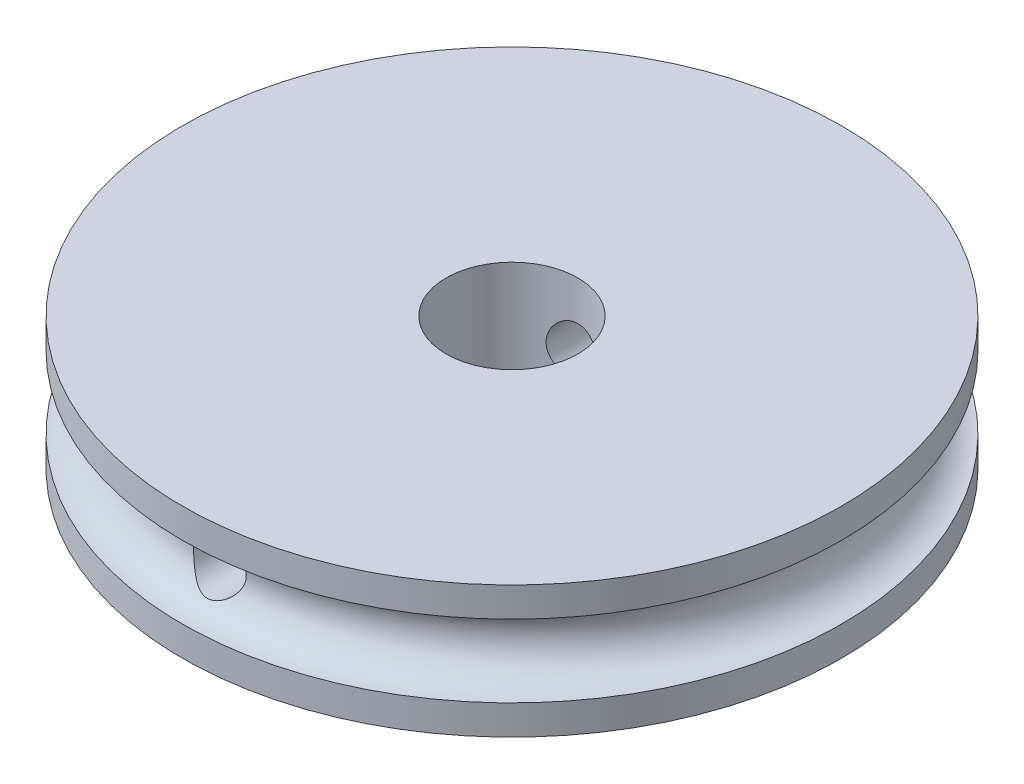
ISO-10303-21;
HEADER;
FILE_DESCRIPTION(('STEP AP214'),'2;1');
FILE_NAME('part.step','',(''),(''),'','','');
FILE_SCHEMA(('AUTOMOTIVE_DESIGN { 1 0 10303 214 1 1 1 1 }'));
ENDSEC;
DATA;
#1=APPLICATION_CONTEXT('core data for automotive mechanical design processes');
#2=APPLICATION_PROTOCOL_DEFINITION('international standard','automotive_design',2000,#1);
#3=PRODUCT_CONTEXT('',#1,'mechanical');
#4=PRODUCT('Part','Part','',(#3));
#5=PRODUCT_RELATED_PRODUCT_CATEGORY('part','',(#4));
#6=PRODUCT_DEFINITION_FORMATION('','',#4);
#7=PRODUCT_DEFINITION_CONTEXT('part definition',#1,'design');
#8=PRODUCT_DEFINITION('design','',#6,#7);
#9=PRODUCT_DEFINITION_SHAPE('','',#8);
#10=(LENGTH_UNIT() NAMED_UNIT(*) SI_UNIT(.MILLI.,.METRE.));
#11=(NAMED_UNIT(*) PLANE_ANGLE_UNIT() SI_UNIT($,.RADIAN.));
#12=(NAMED_UNIT(*) SI_UNIT($,.STERADIAN.) SOLID_ANGLE_UNIT());
#13=UNCERTAINTY_MEASURE_WITH_UNIT(LENGTH_MEASURE(1.E-05),#10,'distance_accuracy_value','');
#14=(GEOMETRIC_REPRESENTATION_CONTEXT(3) GLOBAL_UNCERTAINTY_ASSIGNED_CONTEXT((#13)) GLOBAL_UNIT_ASSIGNED_CONTEXT((#10,
#11,#12)) REPRESENTATION_CONTEXT('',''));
#15=CARTESIAN_POINT('',(0.,0.,0.));
#16=DIRECTION('',(0.,0.,1.));
#17=DIRECTION('',(1.,0.,0.));
#18=AXIS2_PLACEMENT_3D('',#15,#16,#17);
#19=CARTESIAN_POINT('',(0.,10.,0.));
#20=DIRECTION('',(0.,-1.,0.));
#21=DIRECTION('',(0.,0.,-1.));
#22=AXIS2_PLACEMENT_3D('',#19,#20,#21);
#23=CYLINDRICAL_SURFACE('',#22,25.);
#24=CARTESIAN_POINT('',(0.,7.75,0.));
#25=DIRECTION('',(0.,1.,0.));
#26=DIRECTION('',(0.,0.,1.));
#27=AXIS2_PLACEMENT_3D('',#24,#25,#26);
#28=CIRCLE('',#27,25.);
#29=CARTESIAN_POINT('',(0.,7.75,25.));
#30=VERTEX_POINT('',#29);
#31=EDGE_CURVE('E30',#30,#30,#28,.T.);
#32=ORIENTED_EDGE('',*,*,#31,.T.);
#33=EDGE_LOOP('',(#32));
#34=FACE_BOUND('',#33,.T.);
#35=CARTESIAN_POINT('',(0.,10.,0.));
#36=DIRECTION('',(0.,-1.,0.));
#37=DIRECTION('',(0.,0.,-1.));
#38=AXIS2_PLACEMENT_3D('',#35,#36,#37);
#39=CIRCLE('',#38,25.);
#40=CARTESIAN_POINT('',(0.,10.,-25.));
#41=VERTEX_POINT('',#40);
#42=EDGE_CURVE('E18',#41,#41,#39,.F.);
#43=ORIENTED_EDGE('',*,*,#42,.F.);
#44=EDGE_LOOP('',(#43));
#45=FACE_BOUND('',#44,.T.);
#46=ADVANCED_FACE('F15',(#34,#45),#23,.T.);
#47=CARTESIAN_POINT('',(0.,5.,-25.));
#48=DIRECTION('',(0.,0.,1.));
#49=DIRECTION('',(1.,0.,0.));
#50=AXIS2_PLACEMENT_3D('',#47,#48,#49);
#51=CYLINDRICAL_SURFACE('',#50,2.);
#52=CARTESIAN_POINT('',(1.99999999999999,5.,-22.1599300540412));
#53=CARTESIAN_POINT('',(1.99999952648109,4.9519681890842,-22.1599305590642));
#54=CARTESIAN_POINT('',(1.99826504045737,4.90392474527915,-22.1613548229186));
#55=CARTESIAN_POINT('',(1.99136551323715,4.80824187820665,-22.167007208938));
#56=CARTESIAN_POINT('',(1.98619843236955,4.76060271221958,-22.171236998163));
#57=CARTESIAN_POINT('',(1.96563924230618,4.61872068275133,-22.1880127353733));
#58=CARTESIAN_POINT('',(1.94518945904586,4.52562366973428,-22.2046447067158));
#59=CARTESIAN_POINT('',(1.89234905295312,4.34597120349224,-22.2470130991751));
#60=CARTESIAN_POINT('',(1.86004336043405,4.25937437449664,-22.2726847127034));
#61=CARTESIAN_POINT('',(1.78505882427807,4.09343709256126,-22.3310719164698));
#62=CARTESIAN_POINT('',(1.74237983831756,4.01409673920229,-22.3637876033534));
#63=CARTESIAN_POINT('',(1.63107045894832,3.83628393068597,-22.446806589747));
#64=CARTESIAN_POINT('',(1.55862588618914,3.74118351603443,-22.4992050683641));
#65=CARTESIAN_POINT('',(1.39935979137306,3.56617447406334,-22.6081135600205));
#66=CARTESIAN_POINT('',(1.31249617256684,3.48631184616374,-22.664635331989));
#67=CARTESIAN_POINT('',(1.17173970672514,3.37809206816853,-22.748654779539));
#68=CARTESIAN_POINT('',(1.12268956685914,3.34374558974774,-22.7767312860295));
#69=CARTESIAN_POINT('',(1.02118717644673,3.27930423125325,-22.8316869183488));
#70=CARTESIAN_POINT('',(0.968733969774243,3.24921055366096,-22.8585657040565));
#71=CARTESIAN_POINT('',(0.860625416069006,3.19362143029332,-22.9100645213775));
#72=CARTESIAN_POINT('',(0.804980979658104,3.16811142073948,-22.9346915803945));
#73=CARTESIAN_POINT('',(0.690423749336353,3.12193376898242,-22.9806386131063));
#74=CARTESIAN_POINT('',(0.631511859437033,3.10126479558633,-23.0019594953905));
#75=CARTESIAN_POINT('',(0.496648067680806,3.06109839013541,-23.0443537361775));
#76=CARTESIAN_POINT('',(0.419887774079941,3.04295781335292,-23.0642479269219));
#77=CARTESIAN_POINT('',(0.302358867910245,3.02258708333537,-23.0869205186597));
#78=CARTESIAN_POINT('',(0.262833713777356,3.01693957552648,-23.0932798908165));
#79=CARTESIAN_POINT('',(0.183193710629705,3.00800576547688,-23.1033907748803));
#80=CARTESIAN_POINT('',(0.14307925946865,3.00471793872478,-23.1071439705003));
#81=CARTESIAN_POINT('',(0.0857297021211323,3.00176464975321,-23.1105203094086));
#82=CARTESIAN_POINT('',(0.0686016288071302,3.00110336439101,-23.1112773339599));
#83=CARTESIAN_POINT('',(0.0343167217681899,3.00022087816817,-23.112288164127));
#84=CARTESIAN_POINT('',(0.0171598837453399,2.99999975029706,-23.1125418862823));
#85=CARTESIAN_POINT('',(-0.0461655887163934,3.00000067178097,-23.1125400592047));
#86=CARTESIAN_POINT('',(-0.0923532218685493,3.00160363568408,-23.110698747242));
#87=CARTESIAN_POINT('',(-0.184250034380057,3.00797149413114,-23.1034359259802));
#88=CARTESIAN_POINT('',(-0.229958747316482,3.0127392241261,-23.0980112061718));
#89=CARTESIAN_POINT('',(-0.320577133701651,3.02532813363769,-23.0838562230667));
#90=CARTESIAN_POINT('',(-0.365483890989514,3.0331587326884,-23.0751157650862));
#91=CARTESIAN_POINT('',(-0.454043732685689,3.05169446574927,-23.0547530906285));
#92=CARTESIAN_POINT('',(-0.49769601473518,3.06240139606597,-23.0431290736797));
#93=CARTESIAN_POINT('',(-0.625113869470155,3.09817697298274,-23.0050427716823));
#94=CARTESIAN_POINT('',(-0.706782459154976,3.1271117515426,-22.9751130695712));
#95=CARTESIAN_POINT('',(-0.86367987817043,3.19407756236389,-22.909455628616));
#96=CARTESIAN_POINT('',(-0.938906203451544,3.23211211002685,-22.8737256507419));
#97=CARTESIAN_POINT('',(-1.06445716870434,3.30566358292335,-22.80882596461));
#98=CARTESIAN_POINT('',(-1.11622537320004,3.33933085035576,-22.7803194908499));
#99=CARTESIAN_POINT('',(-1.21618563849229,3.41107550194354,-22.7225843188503));
#100=CARTESIAN_POINT('',(-1.26437626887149,3.44915463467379,-22.6933553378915));
#101=CARTESIAN_POINT('',(-1.40350957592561,3.56987932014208,-22.605824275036));
#102=CARTESIAN_POINT('',(-1.48906918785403,3.65904485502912,-22.5476476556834));
#103=CARTESIAN_POINT('',(-1.62969118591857,3.83618965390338,-22.4478155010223));
#104=CARTESIAN_POINT('',(-1.68746979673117,3.92142226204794,-22.405081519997));
#105=CARTESIAN_POINT('',(-1.79028968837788,4.10242260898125,-22.32721145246));
#106=CARTESIAN_POINT('',(-1.83535020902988,4.19817412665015,-22.2920639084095));
#107=CARTESIAN_POINT('',(-1.90391062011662,4.38116792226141,-22.2378320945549));
#108=CARTESIAN_POINT('',(-1.92979506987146,4.46700332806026,-22.2170187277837));
#109=CARTESIAN_POINT('',(-1.96992056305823,4.64293026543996,-22.184555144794));
#110=CARTESIAN_POINT('',(-1.98419136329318,4.73301029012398,-22.1728815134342));
#111=CARTESIAN_POINT('',(-1.99481687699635,4.85311722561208,-22.1641799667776));
#112=CARTESIAN_POINT('',(-1.99675814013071,4.88243028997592,-22.1625888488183));
#113=CARTESIAN_POINT('',(-1.99934995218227,4.94116077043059,-22.1604636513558));
#114=CARTESIAN_POINT('',(-2.00000029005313,4.97057820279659,-22.1599297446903));
#115=CARTESIAN_POINT('',(-1.9999995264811,5.04803181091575,-22.1599305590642));
#116=CARTESIAN_POINT('',(-1.99826504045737,5.09607525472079,-22.1613548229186));
#117=CARTESIAN_POINT('',(-1.99136551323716,5.19175812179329,-22.167007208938));
#118=CARTESIAN_POINT('',(-1.98619843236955,5.23939728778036,-22.171236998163));
#119=CARTESIAN_POINT('',(-1.9656392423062,5.38127931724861,-22.1880127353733));
#120=CARTESIAN_POINT('',(-1.94518945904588,5.47437633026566,-22.2046447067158));
#121=CARTESIAN_POINT('',(-1.89234905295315,5.6540287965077,-22.2470130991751));
#122=CARTESIAN_POINT('',(-1.86004336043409,5.74062562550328,-22.2726847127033));
#123=CARTESIAN_POINT('',(-1.78505882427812,5.90656290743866,-22.3310719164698));
#124=CARTESIAN_POINT('',(-1.7423798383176,5.98590326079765,-22.3637876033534));
#125=CARTESIAN_POINT('',(-1.63107045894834,6.16371606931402,-22.446806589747));
#126=CARTESIAN_POINT('',(-1.55862588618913,6.2588164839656,-22.4992050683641));
#127=CARTESIAN_POINT('',(-1.39935979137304,6.43382552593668,-22.6081135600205));
#128=CARTESIAN_POINT('',(-1.31249617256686,6.51368815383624,-22.664635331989));
#129=CARTESIAN_POINT('',(-1.17173970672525,6.62190793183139,-22.748654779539));
#130=CARTESIAN_POINT('',(-1.12268956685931,6.65625441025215,-22.7767312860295));
#131=CARTESIAN_POINT('',(-1.02118717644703,6.72069576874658,-22.8316869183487));
#132=CARTESIAN_POINT('',(-0.968733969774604,6.75078944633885,-22.8585657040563));
#133=CARTESIAN_POINT('',(-0.860625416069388,6.80637856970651,-22.9100645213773));
#134=CARTESIAN_POINT('',(-0.804980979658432,6.83188857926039,-22.9346915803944));
#135=CARTESIAN_POINT('',(-0.690423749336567,6.87806623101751,-22.9806386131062));
#136=CARTESIAN_POINT('',(-0.63151185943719,6.89873520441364,-23.0019594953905));
#137=CARTESIAN_POINT('',(-0.496648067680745,6.9389016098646,-23.0443537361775));
#138=CARTESIAN_POINT('',(-0.41988777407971,6.95704218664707,-23.0642479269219));
#139=CARTESIAN_POINT('',(-0.302358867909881,6.97741291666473,-23.0869205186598));
#140=CARTESIAN_POINT('',(-0.262833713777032,6.98306042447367,-23.0932798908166));
#141=CARTESIAN_POINT('',(-0.183193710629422,6.99199423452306,-23.1033907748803));
#142=CARTESIAN_POINT('',(-0.143079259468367,6.99528206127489,-23.1071439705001));
#143=CARTESIAN_POINT('',(-0.0857297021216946,6.99823535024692,-23.1105203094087));
#144=CARTESIAN_POINT('',(-0.0686016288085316,6.99889663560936,-23.11127733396));
#145=CARTESIAN_POINT('',(-0.034316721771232,6.99977912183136,-23.1122881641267));
#146=CARTESIAN_POINT('',(-0.0171598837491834,7.00000024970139,-23.1125418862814));
#147=CARTESIAN_POINT('',(0.0461655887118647,6.99999932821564,-23.1125400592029));
#148=CARTESIAN_POINT('',(0.0923532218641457,6.99839636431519,-23.1106987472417));
#149=CARTESIAN_POINT('',(0.184250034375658,6.99202850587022,-23.1034359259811));
#150=CARTESIAN_POINT('',(0.229958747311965,6.98726077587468,-23.0980112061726));
#151=CARTESIAN_POINT('',(0.320577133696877,6.97467186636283,-23.0838562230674));
#152=CARTESIAN_POINT('',(0.365483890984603,6.96684126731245,-23.0751157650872));
#153=CARTESIAN_POINT('',(0.454043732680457,6.94830553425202,-23.0547530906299));
#154=CARTESIAN_POINT('',(0.497696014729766,6.93759860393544,-23.0431290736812));
#155=CARTESIAN_POINT('',(0.625113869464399,6.9018230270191,-23.0050427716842));
#156=CARTESIAN_POINT('',(0.706782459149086,6.8728882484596,-22.9751130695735));
#157=CARTESIAN_POINT('',(0.863679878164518,6.80592243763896,-22.9094556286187));
#158=CARTESIAN_POINT('',(0.938906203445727,6.76788788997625,-22.8737256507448));
#159=CARTESIAN_POINT('',(1.06445716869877,6.69433641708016,-22.808825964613));
#160=CARTESIAN_POINT('',(1.1162253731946,6.6606691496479,-22.7803194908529));
#161=CARTESIAN_POINT('',(1.21618563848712,6.58892449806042,-22.7225843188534));
#162=CARTESIAN_POINT('',(1.26437626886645,6.55084536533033,-22.6933553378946));
#163=CARTESIAN_POINT('',(1.40350957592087,6.43012067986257,-22.6058242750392));
#164=CARTESIAN_POINT('',(1.48906918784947,6.34095514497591,-22.5476476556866));
#165=CARTESIAN_POINT('',(1.62969118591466,6.1638103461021,-22.4478155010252));
#166=CARTESIAN_POINT('',(1.68746979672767,6.07857773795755,-22.4050815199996));
#167=CARTESIAN_POINT('',(1.79028968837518,5.89757739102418,-22.3272114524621));
#168=CARTESIAN_POINT('',(1.83535020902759,5.80182587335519,-22.2920639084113));
#169=CARTESIAN_POINT('',(1.90391062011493,5.61883207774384,-22.2378320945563));
#170=CARTESIAN_POINT('',(1.92979506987,5.53299667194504,-22.2170187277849));
#171=CARTESIAN_POINT('',(1.96992056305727,5.35706973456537,-22.1845551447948));
#172=CARTESIAN_POINT('',(1.98419136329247,5.26698970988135,-22.1728815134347));
#173=CARTESIAN_POINT('',(1.99481687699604,5.14688277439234,-22.1641799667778));
#174=CARTESIAN_POINT('',(1.99675814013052,5.11756971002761,-22.1625888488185));
#175=CARTESIAN_POINT('',(1.99934995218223,5.05883922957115,-22.1604636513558));
#176=CARTESIAN_POINT('',(2.00000029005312,5.02942179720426,-22.1599297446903));
#177=CARTESIAN_POINT('',(1.99999999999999,5.,-22.1599300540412));
#178=B_SPLINE_CURVE_WITH_KNOTS('',3,(#52,#53,#54,#55,#56,#57,#58,#59,#60,#61,#62,#63,#64,#65,
#66,#67,#68,#69,#70,#71,#72,#73,#74,#75,#76,#77,#78,#79,#80,#81,#82,#83,#84,#85,#86,#87,#88,#89,
#90,#91,#92,#93,#94,#95,#96,#97,#98,#99,#100,#101,#102,#103,#104,#105,#106,#107,#108,#109,#110,
#111,#112,#113,#114,#115,#116,#117,#118,#119,#120,#121,#122,#123,#124,#125,#126,#127,#128,#129,
#130,#131,#132,#133,#134,#135,#136,#137,#138,#139,#140,#141,#142,#143,#144,#145,#146,#147,#148,
#149,#150,#151,#152,#153,#154,#155,#156,#157,#158,#159,#160,#161,#162,#163,#164,#165,#166,#167,
#168,#169,#170,#171,#172,#173,#174,#175,#176,#177),.UNSPECIFIED.,.T.,.F.,(4,2,2,2,2,2,2,2,2,2,2,
2,2,2,2,2,2,2,2,2,2,2,2,2,2,2,2,2,2,2,2,2,2,2,2,2,2,2,2,2,2,2,2,2,2,2,2,2,2,2,2,2,2,2,2,2,2,2,2,
2,2,2,4),(0.,0.144058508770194,0.288202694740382,0.576817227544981,0.863403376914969,
1.14999345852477,1.53958291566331,1.93033046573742,2.12854944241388,2.32682435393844,
2.52445769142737,2.72203661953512,2.96494779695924,3.08611074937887,3.20719535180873,
3.25865726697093,3.31012771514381,3.44859972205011,3.58719595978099,3.72622183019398,
3.86533472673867,4.139182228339,4.4131356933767,4.61693224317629,4.82080984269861,
5.22835378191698,5.56160702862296,5.89435339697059,6.16935630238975,6.44365234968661,
6.53188070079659,6.62012347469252,6.76418198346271,6.9083261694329,7.19694070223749,
7.48352685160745,7.77011693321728,8.15970639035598,8.55045394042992,8.74867291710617,
8.9469478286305,9.14458116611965,9.34216009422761,9.58507127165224,9.70623422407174,
9.82731882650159,9.87878074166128,9.93025118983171,10.0687231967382,10.2073194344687,
10.3463453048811,10.4854582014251,10.7593057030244,11.0332591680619,11.2370557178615,
11.4409333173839,11.8484772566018,12.1817305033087,12.5144768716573,12.7894797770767,
13.0637758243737,13.1520041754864,13.240246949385),.UNSPECIFIED.);
#179=CARTESIAN_POINT('',(1.99999999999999,5.,-22.1599300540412));
#180=VERTEX_POINT('',#179);
#181=EDGE_CURVE('E61',#180,#180,#178,.T.);
#182=ORIENTED_EDGE('',*,*,#181,.T.);
#183=EDGE_LOOP('',(#182));
#184=FACE_BOUND('',#183,.T.);
#185=CARTESIAN_POINT('',(0.,3.,-5.));
#186=CARTESIAN_POINT('',(0.107680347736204,3.00000415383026,-4.99999665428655));
#187=CARTESIAN_POINT('',(0.215405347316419,3.00873343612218,-4.99648702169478));
#188=CARTESIAN_POINT('',(0.42767892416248,3.0432996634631,-4.98281368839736));
#189=CARTESIAN_POINT('',(0.53222499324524,3.06914976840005,-4.97264486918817));
#190=CARTESIAN_POINT('',(0.734936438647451,3.13686789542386,-4.94674533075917));
#191=CARTESIAN_POINT('',(0.833117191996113,3.17869549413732,-4.93102865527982));
#192=CARTESIAN_POINT('',(1.02102929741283,3.27699345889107,-4.89557507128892));
#193=CARTESIAN_POINT('',(1.1107597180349,3.33346543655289,-4.87583772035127));
#194=CARTESIAN_POINT('',(1.28349946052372,3.46223381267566,-4.8333093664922));
#195=CARTESIAN_POINT('',(1.36605856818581,3.53510265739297,-4.81042399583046));
#196=CARTESIAN_POINT('',(1.51817177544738,3.69339678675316,-4.76460683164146));
#197=CARTESIAN_POINT('',(1.58771891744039,3.77882874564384,-4.74167501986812));
#198=CARTESIAN_POINT('',(1.71490201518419,3.96446585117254,-4.69721815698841));
#199=CARTESIAN_POINT('',(1.77186247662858,4.06516226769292,-4.67580259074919));
#200=CARTESIAN_POINT('',(1.86778931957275,4.2756406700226,-4.63832295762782));
#201=CARTESIAN_POINT('',(1.90677948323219,4.38541041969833,-4.62225182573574));
#202=CARTESIAN_POINT('',(1.95714803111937,4.57965717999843,-4.60109623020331));
#203=CARTESIAN_POINT('',(1.97317642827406,4.66275735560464,-4.59420393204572));
#204=CARTESIAN_POINT('',(1.99460320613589,4.83056249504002,-4.58494225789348));
#205=CARTESIAN_POINT('',(2.00000349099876,4.91526716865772,-4.58257207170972));
#206=CARTESIAN_POINT('',(1.99999557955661,5.10729212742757,-4.58258028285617));
#207=CARTESIAN_POINT('',(1.99132693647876,5.21462940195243,-4.58639095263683));
#208=CARTESIAN_POINT('',(1.95702361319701,5.42609516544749,-4.60112927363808));
#209=CARTESIAN_POINT('',(1.9313742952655,5.53022080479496,-4.61206306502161));
#210=CARTESIAN_POINT('',(1.86424202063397,5.73203783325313,-4.63960148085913));
#211=CARTESIAN_POINT('',(1.82280828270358,5.82974812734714,-4.65618846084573));
#212=CARTESIAN_POINT('',(1.72544157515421,6.01684954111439,-4.69313894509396));
#213=CARTESIAN_POINT('',(1.66950621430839,6.10623928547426,-4.71350307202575));
#214=CARTESIAN_POINT('',(1.54132425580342,6.27925792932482,-4.75700791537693));
#215=CARTESIAN_POINT('',(1.46838464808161,6.36235116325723,-4.78023770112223));
#216=CARTESIAN_POINT('',(1.30971391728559,6.51552450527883,-4.82612312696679));
#217=CARTESIAN_POINT('',(1.22397753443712,6.58559923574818,-4.84877852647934));
#218=CARTESIAN_POINT('',(1.03796954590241,6.71343313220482,-4.89204323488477));
#219=CARTESIAN_POINT('',(0.937255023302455,6.77059061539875,-4.91253510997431));
#220=CARTESIAN_POINT('',(0.72672428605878,6.86687731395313,-4.9480517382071));
#221=CARTESIAN_POINT('',(0.616919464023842,6.90602870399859,-4.96308321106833));
#222=CARTESIAN_POINT('',(0.422274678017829,6.95675138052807,-4.9828207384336));
#223=CARTESIAN_POINT('',(0.33878005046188,6.97293003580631,-4.98922395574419));
#224=CARTESIAN_POINT('',(0.170199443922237,6.99455529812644,-4.99781463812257));
#225=CARTESIAN_POINT('',(0.0851136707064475,7.00000328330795,-5.00000264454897));
#226=CARTESIAN_POINT('',(-0.107680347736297,6.99999584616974,-4.99999665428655));
#227=CARTESIAN_POINT('',(-0.215405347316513,6.99126656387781,-4.99648702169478));
#228=CARTESIAN_POINT('',(-0.427678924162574,6.95670033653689,-4.98281368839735));
#229=CARTESIAN_POINT('',(-0.532224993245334,6.93085023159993,-4.97264486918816));
#230=CARTESIAN_POINT('',(-0.734936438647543,6.86313210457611,-4.94674533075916));
#231=CARTESIAN_POINT('',(-0.833117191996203,6.82130450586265,-4.9310286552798));
#232=CARTESIAN_POINT('',(-1.02102929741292,6.72300654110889,-4.89557507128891));
#233=CARTESIAN_POINT('',(-1.11075971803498,6.66653456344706,-4.87583772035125));
#234=CARTESIAN_POINT('',(-1.28349946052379,6.53776618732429,-4.83330936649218));
#235=CARTESIAN_POINT('',(-1.36605856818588,6.46489734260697,-4.81042399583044));
#236=CARTESIAN_POINT('',(-1.51817177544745,6.30660321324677,-4.76460683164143));
#237=CARTESIAN_POINT('',(-1.58771891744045,6.22117125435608,-4.7416750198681));
#238=CARTESIAN_POINT('',(-1.71490201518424,6.03553414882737,-4.6972181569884));
#239=CARTESIAN_POINT('',(-1.77186247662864,5.93483773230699,-4.67580259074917));
#240=CARTESIAN_POINT('',(-1.86778931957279,5.72435932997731,-4.63832295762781));
#241=CARTESIAN_POINT('',(-1.90677948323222,5.61458958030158,-4.62225182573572));
#242=CARTESIAN_POINT('',(-1.95714803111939,5.42034282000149,-4.6010962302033));
#243=CARTESIAN_POINT('',(-1.97317642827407,5.33724264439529,-4.59420393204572));
#244=CARTESIAN_POINT('',(-1.99460320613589,5.16943750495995,-4.58494225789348));
#245=CARTESIAN_POINT('',(-2.00000349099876,5.08473283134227,-4.58257207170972));
#246=CARTESIAN_POINT('',(-1.99999557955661,4.89270787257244,-4.58258028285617));
#247=CARTESIAN_POINT('',(-1.99132693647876,4.78537059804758,-4.58639095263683));
#248=CARTESIAN_POINT('',(-1.95702361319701,4.57390483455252,-4.60112927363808));
#249=CARTESIAN_POINT('',(-1.9313742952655,4.46977919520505,-4.61206306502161));
#250=CARTESIAN_POINT('',(-1.86424202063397,4.26796216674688,-4.63960148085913));
#251=CARTESIAN_POINT('',(-1.82280828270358,4.17025187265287,-4.65618846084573));
#252=CARTESIAN_POINT('',(-1.72544157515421,3.98315045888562,-4.69313894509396));
#253=CARTESIAN_POINT('',(-1.66950621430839,3.89376071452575,-4.71350307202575));
#254=CARTESIAN_POINT('',(-1.54132425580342,3.72074207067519,-4.75700791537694));
#255=CARTESIAN_POINT('',(-1.46838464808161,3.63764883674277,-4.78023770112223));
#256=CARTESIAN_POINT('',(-1.30971391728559,3.48447549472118,-4.82612312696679));
#257=CARTESIAN_POINT('',(-1.22397753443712,3.41440076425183,-4.84877852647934));
#258=CARTESIAN_POINT('',(-1.03796954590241,3.28656686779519,-4.89204323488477));
#259=CARTESIAN_POINT('',(-0.937255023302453,3.22940938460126,-4.91253510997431));
#260=CARTESIAN_POINT('',(-0.726724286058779,3.13312268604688,-4.9480517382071));
#261=CARTESIAN_POINT('',(-0.616919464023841,3.09397129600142,-4.96308321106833));
#262=CARTESIAN_POINT('',(-0.422274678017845,3.04324861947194,-4.9828207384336));
#263=CARTESIAN_POINT('',(-0.338780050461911,3.0270699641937,-4.98922395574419));
#264=CARTESIAN_POINT('',(-0.170199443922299,3.00544470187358,-4.99781463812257));
#265=CARTESIAN_POINT('',(-0.0851136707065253,2.99999671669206,-5.00000264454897));
#266=CARTESIAN_POINT('',(0.,3.,-5.));
#267=B_SPLINE_CURVE_WITH_KNOTS('',3,(#185,#186,#187,#188,#189,#190,#191,#192,#193,#194,#195,
#196,#197,#198,#199,#200,#201,#202,#203,#204,#205,#206,#207,#208,#209,#210,#211,#212,#213,#214,
#215,#216,#217,#218,#219,#220,#221,#222,#223,#224,#225,#226,#227,#228,#229,#230,#231,#232,#233,
#234,#235,#236,#237,#238,#239,#240,#241,#242,#243,#244,#245,#246,#247,#248,#249,#250,#251,#252,
#253,#254,#255,#256,#257,#258,#259,#260,#261,#262,#263,#264,#265,#266),.UNSPECIFIED.,.T.,.F.,(4,
2,2,2,2,2,2,2,2,2,2,2,2,2,2,2,2,2,2,2,2,2,2,2,2,2,2,2,2,2,2,2,2,2,2,2,2,2,2,2,4),(0.,
0.322717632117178,0.645683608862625,0.967837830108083,1.29002751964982,1.62596616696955,
1.96208393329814,2.31330216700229,2.66405424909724,2.91804039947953,3.17198104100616,
3.4935309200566,3.81535834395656,4.13619035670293,4.45707530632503,4.79452649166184,
5.13211676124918,5.48315297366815,5.83375571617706,6.08887386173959,6.34395924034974,
6.66667687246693,6.98964284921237,7.31179707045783,7.63398675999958,7.96992540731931,
8.3060431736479,8.65726140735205,9.008013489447,9.26199963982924,9.51594028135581,
9.83749016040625,10.1593175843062,10.4801495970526,10.8010345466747,11.1384857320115,
11.4760760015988,11.8271122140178,12.1777149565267,12.4328331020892,12.6879184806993),.UNSPECIFIED.);
#268=CARTESIAN_POINT('',(0.,3.,-5.));
#269=VERTEX_POINT('',#268);
#270=EDGE_CURVE('E56',#269,#269,#267,.T.);
#271=ORIENTED_EDGE('',*,*,#270,.T.);
#272=EDGE_LOOP('',(#271));
#273=FACE_BOUND('',#272,.T.);
#274=ADVANCED_FACE('F64',(#184,#273),#51,.F.);
#275=CARTESIAN_POINT('',(0.,10.,0.));
#276=DIRECTION('',(0.,1.,0.));
#277=DIRECTION('',(0.,0.,1.));
#278=AXIS2_PLACEMENT_3D('',#275,#276,#277);
#279=PLANE('',#278);
#280=ORIENTED_EDGE('',*,*,#42,.T.);
#281=EDGE_LOOP('',(#280));
#282=FACE_BOUND('',#281,.T.);
#283=CARTESIAN_POINT('',(0.,10.,0.));
#284=DIRECTION('',(0.,1.,0.));
#285=DIRECTION('',(0.,0.,1.));
#286=AXIS2_PLACEMENT_3D('',#283,#284,#285);
#287=CIRCLE('',#286,5.);
#288=CARTESIAN_POINT('',(0.,10.,5.));
#289=VERTEX_POINT('',#288);
#290=EDGE_CURVE('E40',#289,#289,#287,.F.);
#291=ORIENTED_EDGE('',*,*,#290,.T.);
#292=EDGE_LOOP('',(#291));
#293=FACE_BOUND('',#292,.T.);
#294=ADVANCED_FACE('F67',(#282,#293),#279,.T.);
#295=CARTESIAN_POINT('',(0.,5.,-25.));
#296=DIRECTION('',(0.,0.,1.));
#297=DIRECTION('',(1.,0.,0.));
#298=AXIS2_PLACEMENT_3D('',#295,#296,#297);
#299=CYLINDRICAL_SURFACE('',#298,2.);
#300=CARTESIAN_POINT('',(1.02640302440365E-13,6.99999999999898,23.1125413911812));
#301=CARTESIAN_POINT('',(-0.0461655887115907,6.9999993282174,23.1125400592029));
#302=CARTESIAN_POINT('',(-0.0923532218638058,6.99839636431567,23.1106987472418));
#303=CARTESIAN_POINT('',(-0.184250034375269,6.99202850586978,23.1034359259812));
#304=CARTESIAN_POINT('',(-0.229958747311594,6.9872607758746,23.0980112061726));
#305=CARTESIAN_POINT('',(-0.320577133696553,6.97467186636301,23.0838562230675));
#306=CARTESIAN_POINT('',(-0.365483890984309,6.96684126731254,23.0751157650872));
#307=CARTESIAN_POINT('',(-0.454043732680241,6.94830553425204,23.05475309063));
#308=CARTESIAN_POINT('',(-0.497696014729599,6.93759860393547,23.0431290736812));
#309=CARTESIAN_POINT('',(-0.625113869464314,6.90182302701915,23.0050427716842));
#310=CARTESIAN_POINT('',(-0.706782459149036,6.87288824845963,22.9751130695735));
#311=CARTESIAN_POINT('',(-0.863679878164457,6.80592243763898,22.9094556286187));
#312=CARTESIAN_POINT('',(-0.938906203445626,6.76788788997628,22.8737256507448));
#313=CARTESIAN_POINT('',(-1.06445716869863,6.69433641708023,22.8088259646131));
#314=CARTESIAN_POINT('',(-1.11622537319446,6.66066914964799,22.780319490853));
#315=CARTESIAN_POINT('',(-1.21618563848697,6.58892449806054,22.7225843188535));
#316=CARTESIAN_POINT('',(-1.26437626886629,6.55084536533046,22.6933553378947));
#317=CARTESIAN_POINT('',(-1.40350957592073,6.4301206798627,22.6058242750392));
#318=CARTESIAN_POINT('',(-1.48906918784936,6.34095514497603,22.5476476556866));
#319=CARTESIAN_POINT('',(-1.62969118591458,6.16381034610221,22.4478155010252));
#320=CARTESIAN_POINT('',(-1.6874697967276,6.07857773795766,22.4050815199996));
#321=CARTESIAN_POINT('',(-1.79028968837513,5.89757739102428,22.3272114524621));
#322=CARTESIAN_POINT('',(-1.83535020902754,5.8018258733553,22.2920639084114));
#323=CARTESIAN_POINT('',(-1.90391062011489,5.61883207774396,22.2378320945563));
#324=CARTESIAN_POINT('',(-1.92979506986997,5.53299667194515,22.2170187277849));
#325=CARTESIAN_POINT('',(-1.96992056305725,5.35706973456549,22.1845551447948));
#326=CARTESIAN_POINT('',(-1.98419136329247,5.26698970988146,22.1728815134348));
#327=CARTESIAN_POINT('',(-1.99481687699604,5.14688277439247,22.1641799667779));
#328=CARTESIAN_POINT('',(-1.99675814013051,5.11756971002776,22.1625888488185));
#329=CARTESIAN_POINT('',(-1.99934995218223,5.05883922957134,22.1604636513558));
#330=CARTESIAN_POINT('',(-2.00000029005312,5.02942179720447,22.1599297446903));
#331=CARTESIAN_POINT('',(-1.99999952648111,4.95196818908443,22.1599305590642));
#332=CARTESIAN_POINT('',(-1.99826504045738,4.90392474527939,22.1613548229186));
#333=CARTESIAN_POINT('',(-1.99136551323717,4.80824187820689,22.167007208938));
#334=CARTESIAN_POINT('',(-1.98619843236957,4.76060271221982,22.171236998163));
#335=CARTESIAN_POINT('',(-1.96563924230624,4.61872068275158,22.1880127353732));
#336=CARTESIAN_POINT('',(-1.94518945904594,4.52562366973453,22.2046447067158));
#337=CARTESIAN_POINT('',(-1.89234905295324,4.3459712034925,22.2470130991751));
#338=CARTESIAN_POINT('',(-1.86004336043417,4.25937437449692,22.2726847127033));
#339=CARTESIAN_POINT('',(-1.78505882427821,4.09343709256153,22.3310719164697));
#340=CARTESIAN_POINT('',(-1.74237983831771,4.01409673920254,22.3637876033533));
#341=CARTESIAN_POINT('',(-1.63107045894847,3.83628393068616,22.4468065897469));
#342=CARTESIAN_POINT('',(-1.55862588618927,3.74118351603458,22.499205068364));
#343=CARTESIAN_POINT('',(-1.39935979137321,3.56617447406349,22.6081135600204));
#344=CARTESIAN_POINT('',(-1.31249617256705,3.48631184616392,22.6646353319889));
#345=CARTESIAN_POINT('',(-1.17173970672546,3.37809206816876,22.7486547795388));
#346=CARTESIAN_POINT('',(-1.12268956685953,3.34374558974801,22.7767312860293));
#347=CARTESIAN_POINT('',(-1.02118717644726,3.27930423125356,22.8316869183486));
#348=CARTESIAN_POINT('',(-0.968733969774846,3.24921055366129,22.8585657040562));
#349=CARTESIAN_POINT('',(-0.860625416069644,3.19362143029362,22.9100645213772));
#350=CARTESIAN_POINT('',(-0.804980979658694,3.16811142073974,22.9346915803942));
#351=CARTESIAN_POINT('',(-0.690423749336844,3.1219337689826,22.9806386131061));
#352=CARTESIAN_POINT('',(-0.631511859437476,3.10126479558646,23.0019594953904));
#353=CARTESIAN_POINT('',(-0.496648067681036,3.06109839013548,23.0443537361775));
#354=CARTESIAN_POINT('',(-0.419887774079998,3.042957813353,23.0642479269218));
#355=CARTESIAN_POINT('',(-0.302358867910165,3.02258708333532,23.0869205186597));
#356=CARTESIAN_POINT('',(-0.262833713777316,3.01693957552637,23.0932798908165));
#357=CARTESIAN_POINT('',(-0.183193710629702,3.00800576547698,23.1033907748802));
#358=CARTESIAN_POINT('',(-0.143079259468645,3.00471793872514,23.1071439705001));
#359=CARTESIAN_POINT('',(-0.0857297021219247,3.0017646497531,23.1105203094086));
#360=CARTESIAN_POINT('',(-0.0686016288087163,3.00110336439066,23.11127733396));
#361=CARTESIAN_POINT('',(-0.0343167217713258,3.00022087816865,23.1122881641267));
#362=CARTESIAN_POINT('',(-0.0171598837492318,2.99999975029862,23.1125418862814));
#363=CARTESIAN_POINT('',(0.0461655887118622,3.00000067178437,23.1125400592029));
#364=CARTESIAN_POINT('',(0.0923532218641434,3.00160363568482,23.1106987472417));
#365=CARTESIAN_POINT('',(0.184250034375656,3.00797149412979,23.1034359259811));
#366=CARTESIAN_POINT('',(0.229958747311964,3.01273922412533,23.0980112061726));
#367=CARTESIAN_POINT('',(0.320577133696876,3.02532813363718,23.0838562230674));
#368=CARTESIAN_POINT('',(0.365483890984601,3.03315873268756,23.0751157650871));
#369=CARTESIAN_POINT('',(0.454043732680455,3.05169446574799,23.0547530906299));
#370=CARTESIAN_POINT('',(0.497696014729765,3.06240139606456,23.0431290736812));
#371=CARTESIAN_POINT('',(0.625113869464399,3.09817697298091,23.0050427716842));
#372=CARTESIAN_POINT('',(0.706782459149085,3.1271117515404,22.9751130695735));
#373=CARTESIAN_POINT('',(0.863679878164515,3.19407756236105,22.9094556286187));
#374=CARTESIAN_POINT('',(0.938906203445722,3.23211211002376,22.8737256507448));
#375=CARTESIAN_POINT('',(1.06445716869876,3.30566358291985,22.808825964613));
#376=CARTESIAN_POINT('',(1.1162253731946,3.33933085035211,22.7803194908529));
#377=CARTESIAN_POINT('',(1.21618563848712,3.41107550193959,22.7225843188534));
#378=CARTESIAN_POINT('',(1.26437626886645,3.44915463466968,22.6933553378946));
#379=CARTESIAN_POINT('',(1.40350957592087,3.56987932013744,22.6058242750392));
#380=CARTESIAN_POINT('',(1.48906918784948,3.65904485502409,22.5476476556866));
#381=CARTESIAN_POINT('',(1.62969118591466,3.8361896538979,22.4478155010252));
#382=CARTESIAN_POINT('',(1.68746979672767,3.92142226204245,22.4050815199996));
#383=CARTESIAN_POINT('',(1.79028968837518,4.10242260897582,22.3272114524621));
#384=CARTESIAN_POINT('',(1.83535020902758,4.19817412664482,22.2920639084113));
#385=CARTESIAN_POINT('',(1.90391062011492,4.38116792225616,22.2378320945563));
#386=CARTESIAN_POINT('',(1.92979506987,4.46700332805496,22.2170187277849));
#387=CARTESIAN_POINT('',(1.96992056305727,4.64293026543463,22.1845551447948));
#388=CARTESIAN_POINT('',(1.98419136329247,4.73301029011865,22.1728815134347));
#389=CARTESIAN_POINT('',(1.99481687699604,4.85311722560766,22.1641799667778));
#390=CARTESIAN_POINT('',(1.99675814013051,4.88243028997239,22.1625888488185));
#391=CARTESIAN_POINT('',(1.99934995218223,4.94116077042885,22.1604636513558));
#392=CARTESIAN_POINT('',(2.00000029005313,4.97057820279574,22.1599297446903));
#393=CARTESIAN_POINT('',(1.99999952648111,5.04803181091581,22.1599305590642));
#394=CARTESIAN_POINT('',(1.99826504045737,5.09607525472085,22.1613548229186));
#395=CARTESIAN_POINT('',(1.99136551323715,5.19175812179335,22.167007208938));
#396=CARTESIAN_POINT('',(1.98619843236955,5.23939728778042,22.171236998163));
#397=CARTESIAN_POINT('',(1.96563924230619,5.38127931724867,22.1880127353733));
#398=CARTESIAN_POINT('',(1.94518945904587,5.47437633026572,22.2046447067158));
#399=CARTESIAN_POINT('',(1.89234905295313,5.65402879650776,22.2470130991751));
#400=CARTESIAN_POINT('',(1.86004336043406,5.74062562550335,22.2726847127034));
#401=CARTESIAN_POINT('',(1.78505882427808,5.90656290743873,22.3310719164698));
#402=CARTESIAN_POINT('',(1.74237983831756,5.98590326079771,22.3637876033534));
#403=CARTESIAN_POINT('',(1.6310704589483,6.16371606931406,22.4468065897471));
#404=CARTESIAN_POINT('',(1.5586258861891,6.25881648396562,22.4992050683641));
#405=CARTESIAN_POINT('',(1.39935979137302,6.43382552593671,22.6081135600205));
#406=CARTESIAN_POINT('',(1.31249617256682,6.51368815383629,22.6646353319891));
#407=CARTESIAN_POINT('',(1.17173970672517,6.62190793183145,22.748654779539));
#408=CARTESIAN_POINT('',(1.12268956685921,6.65625441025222,22.7767312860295));
#409=CARTESIAN_POINT('',(1.02118717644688,6.72069576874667,22.8316869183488));
#410=CARTESIAN_POINT('',(0.968733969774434,6.75078944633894,22.8585657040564));
#411=CARTESIAN_POINT('',(0.860625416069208,6.8063785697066,22.9100645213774));
#412=CARTESIAN_POINT('',(0.804980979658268,6.83188857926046,22.9346915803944));
#413=CARTESIAN_POINT('',(0.690423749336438,6.87806623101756,22.9806386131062));
#414=CARTESIAN_POINT('',(0.631511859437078,6.89873520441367,23.0019594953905));
#415=CARTESIAN_POINT('',(0.496648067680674,6.93890160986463,23.0443537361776));
#416=CARTESIAN_POINT('',(0.419887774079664,6.95704218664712,23.0642479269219));
#417=CARTESIAN_POINT('',(0.302358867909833,6.97741291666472,23.0869205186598));
#418=CARTESIAN_POINT('',(0.262833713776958,6.98306042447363,23.0932798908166));
#419=CARTESIAN_POINT('',(0.183193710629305,6.99199423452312,23.1033907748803));
#420=CARTESIAN_POINT('',(0.143079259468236,6.99528206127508,23.1071439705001));
#421=CARTESIAN_POINT('',(0.0857297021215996,6.99823535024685,23.1105203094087));
#422=CARTESIAN_POINT('',(0.0686016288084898,6.99889663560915,23.11127733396));
#423=CARTESIAN_POINT('',(0.034316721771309,6.99977912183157,23.1122881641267));
#424=CARTESIAN_POINT('',(0.017159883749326,7.00000024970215,23.1125418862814));
#425=CARTESIAN_POINT('',(1.02640302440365E-13,6.99999999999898,23.1125413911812));
#426=B_SPLINE_CURVE_WITH_KNOTS('',3,(#300,#301,#302,#303,#304,#305,#306,#307,#308,#309,#310,
#311,#312,#313,#314,#315,#316,#317,#318,#319,#320,#321,#322,#323,#324,#325,#326,#327,#328,#329,
#330,#331,#332,#333,#334,#335,#336,#337,#338,#339,#340,#341,#342,#343,#344,#345,#346,#347,#348,
#349,#350,#351,#352,#353,#354,#355,#356,#357,#358,#359,#360,#361,#362,#363,#364,#365,#366,#367,
#368,#369,#370,#371,#372,#373,#374,#375,#376,#377,#378,#379,#380,#381,#382,#383,#384,#385,#386,
#387,#388,#389,#390,#391,#392,#393,#394,#395,#396,#397,#398,#399,#400,#401,#402,#403,#404,#405,
#406,#407,#408,#409,#410,#411,#412,#413,#414,#415,#416,#417,#418,#419,#420,#421,#422,#423,#424,
#425),.UNSPECIFIED.,.T.,.F.,(4,2,2,2,2,2,2,2,2,2,2,2,2,2,2,2,2,2,2,2,2,2,2,2,2,2,2,2,2,2,2,2,2,
2,2,2,2,2,2,2,2,2,2,2,2,2,2,2,2,2,2,2,2,2,2,2,2,2,2,2,2,2,4),(0.,0.138472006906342,
0.277068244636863,0.416094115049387,0.555207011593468,0.829054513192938,1.10300797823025,
1.30680452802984,1.51068212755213,1.9182260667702,2.25147931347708,2.58422568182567,
2.85922858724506,3.13352463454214,3.22175298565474,3.3099957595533,3.45405426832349,
3.59819845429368,3.88681298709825,4.17339913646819,4.45998921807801,4.84957867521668,
5.2403262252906,5.43854520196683,5.63682011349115,5.8344534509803,6.03203237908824,
6.2749435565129,6.39610650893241,6.51719111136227,6.5686530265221,6.62012347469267,
6.75859548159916,6.89719171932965,7.03621758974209,7.17533048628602,7.44917798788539,
7.72313145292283,7.92692800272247,8.1308056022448,8.53834954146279,8.87160278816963,
9.20434915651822,9.4793520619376,9.75364810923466,9.84187646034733,9.93011923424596,
10.0741777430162,10.2183219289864,10.5069364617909,10.7935226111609,11.0801126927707,
11.4697021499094,11.8604496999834,12.0586686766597,12.2569435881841,12.4545769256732,
12.6521558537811,12.8950670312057,13.0162299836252,13.1373145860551,13.1887765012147,
13.2402469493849),.UNSPECIFIED.);
#427=CARTESIAN_POINT('',(1.02640302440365E-13,6.99999999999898,23.1125413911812));
#428=VERTEX_POINT('',#427);
#429=EDGE_CURVE('E104',#428,#428,#426,.T.);
#430=ORIENTED_EDGE('',*,*,#429,.T.);
#431=EDGE_LOOP('',(#430));
#432=FACE_BOUND('',#431,.T.);
#433=CARTESIAN_POINT('',(0.,7.,5.));
#434=CARTESIAN_POINT('',(0.107680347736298,6.99999584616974,4.99999665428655));
#435=CARTESIAN_POINT('',(0.215405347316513,6.99126656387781,4.99648702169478));
#436=CARTESIAN_POINT('',(0.427678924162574,6.95670033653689,4.98281368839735));
#437=CARTESIAN_POINT('',(0.532224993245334,6.93085023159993,4.97264486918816));
#438=CARTESIAN_POINT('',(0.734936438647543,6.86313210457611,4.94674533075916));
#439=CARTESIAN_POINT('',(0.833117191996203,6.82130450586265,4.9310286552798));
#440=CARTESIAN_POINT('',(1.02102929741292,6.72300654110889,4.89557507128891));
#441=CARTESIAN_POINT('',(1.11075971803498,6.66653456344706,4.87583772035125));
#442=CARTESIAN_POINT('',(1.28349946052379,6.53776618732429,4.83330936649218));
#443=CARTESIAN_POINT('',(1.36605856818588,6.46489734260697,4.81042399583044));
#444=CARTESIAN_POINT('',(1.51817177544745,6.30660321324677,4.76460683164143));
#445=CARTESIAN_POINT('',(1.58771891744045,6.22117125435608,4.7416750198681));
#446=CARTESIAN_POINT('',(1.71490201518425,6.03553414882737,4.69721815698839));
#447=CARTESIAN_POINT('',(1.77186247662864,5.93483773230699,4.67580259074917));
#448=CARTESIAN_POINT('',(1.86778931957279,5.72435932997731,4.63832295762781));
#449=CARTESIAN_POINT('',(1.90677948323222,5.61458958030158,4.62225182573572));
#450=CARTESIAN_POINT('',(1.95714803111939,5.42034282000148,4.6010962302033));
#451=CARTESIAN_POINT('',(1.97317642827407,5.33724264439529,4.59420393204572));
#452=CARTESIAN_POINT('',(1.99460320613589,5.16943750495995,4.58494225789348));
#453=CARTESIAN_POINT('',(2.00000349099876,5.08473283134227,4.58257207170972));
#454=CARTESIAN_POINT('',(1.99999557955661,4.89270787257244,4.58258028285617));
#455=CARTESIAN_POINT('',(1.99132693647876,4.78537059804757,4.58639095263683));
#456=CARTESIAN_POINT('',(1.95702361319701,4.57390483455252,4.60112927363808));
#457=CARTESIAN_POINT('',(1.9313742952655,4.46977919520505,4.61206306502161));
#458=CARTESIAN_POINT('',(1.86424202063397,4.26796216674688,4.63960148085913));
#459=CARTESIAN_POINT('',(1.82280828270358,4.17025187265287,4.65618846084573));
#460=CARTESIAN_POINT('',(1.72544157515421,3.98315045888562,4.69313894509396));
#461=CARTESIAN_POINT('',(1.66950621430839,3.89376071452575,4.71350307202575));
#462=CARTESIAN_POINT('',(1.54132425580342,3.72074207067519,4.75700791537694));
#463=CARTESIAN_POINT('',(1.46838464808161,3.63764883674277,4.78023770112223));
#464=CARTESIAN_POINT('',(1.30971391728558,3.48447549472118,4.82612312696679));
#465=CARTESIAN_POINT('',(1.22397753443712,3.41440076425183,4.84877852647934));
#466=CARTESIAN_POINT('',(1.03796954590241,3.28656686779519,4.89204323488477));
#467=CARTESIAN_POINT('',(0.937255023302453,3.22940938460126,4.91253510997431));
#468=CARTESIAN_POINT('',(0.726724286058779,3.13312268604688,4.9480517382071));
#469=CARTESIAN_POINT('',(0.616919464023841,3.09397129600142,4.96308321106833));
#470=CARTESIAN_POINT('',(0.422274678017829,3.04324861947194,4.9828207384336));
#471=CARTESIAN_POINT('',(0.33878005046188,3.0270699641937,4.98922395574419));
#472=CARTESIAN_POINT('',(0.170199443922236,3.00544470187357,4.99781463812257));
#473=CARTESIAN_POINT('',(0.0851136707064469,2.99999671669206,5.00000264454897));
#474=CARTESIAN_POINT('',(-0.107680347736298,3.00000415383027,4.99999665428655));
#475=CARTESIAN_POINT('',(-0.215405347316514,3.00873343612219,4.99648702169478));
#476=CARTESIAN_POINT('',(-0.427678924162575,3.04329966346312,4.98281368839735));
#477=CARTESIAN_POINT('',(-0.532224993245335,3.06914976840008,4.97264486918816));
#478=CARTESIAN_POINT('',(-0.734936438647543,3.1368678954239,4.94674533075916));
#479=CARTESIAN_POINT('',(-0.833117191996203,3.17869549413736,4.9310286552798));
#480=CARTESIAN_POINT('',(-1.02102929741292,3.27699345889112,4.89557507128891));
#481=CARTESIAN_POINT('',(-1.11075971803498,3.33346543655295,4.87583772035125));
#482=CARTESIAN_POINT('',(-1.28349946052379,3.46223381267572,4.83330936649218));
#483=CARTESIAN_POINT('',(-1.36605856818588,3.53510265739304,4.81042399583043));
#484=CARTESIAN_POINT('',(-1.51817177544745,3.69339678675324,4.76460683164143));
#485=CARTESIAN_POINT('',(-1.58771891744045,3.77882874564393,4.7416750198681));
#486=CARTESIAN_POINT('',(-1.71490201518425,3.96446585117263,4.69721815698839));
#487=CARTESIAN_POINT('',(-1.77186247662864,4.06516226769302,4.67580259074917));
#488=CARTESIAN_POINT('',(-1.86778931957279,4.2756406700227,4.6383229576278));
#489=CARTESIAN_POINT('',(-1.90677948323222,4.38541041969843,4.62225182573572));
#490=CARTESIAN_POINT('',(-1.95714803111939,4.57965717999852,4.6010962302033));
#491=CARTESIAN_POINT('',(-1.97317642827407,4.66275735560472,4.59420393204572));
#492=CARTESIAN_POINT('',(-1.99460320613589,4.83056249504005,4.58494225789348));
#493=CARTESIAN_POINT('',(-2.00000349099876,4.91526716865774,4.58257207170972));
#494=CARTESIAN_POINT('',(-1.99999557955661,5.10729212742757,4.58258028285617));
#495=CARTESIAN_POINT('',(-1.99132693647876,5.21462940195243,4.58639095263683));
#496=CARTESIAN_POINT('',(-1.95702361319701,5.42609516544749,4.60112927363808));
#497=CARTESIAN_POINT('',(-1.9313742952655,5.53022080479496,4.61206306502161));
#498=CARTESIAN_POINT('',(-1.86424202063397,5.73203783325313,4.63960148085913));
#499=CARTESIAN_POINT('',(-1.82280828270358,5.82974812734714,4.65618846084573));
#500=CARTESIAN_POINT('',(-1.72544157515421,6.01684954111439,4.69313894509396));
#501=CARTESIAN_POINT('',(-1.66950621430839,6.10623928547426,4.71350307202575));
#502=CARTESIAN_POINT('',(-1.54132425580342,6.27925792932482,4.75700791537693));
#503=CARTESIAN_POINT('',(-1.46838464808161,6.36235116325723,4.78023770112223));
#504=CARTESIAN_POINT('',(-1.30971391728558,6.51552450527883,4.82612312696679));
#505=CARTESIAN_POINT('',(-1.22397753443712,6.58559923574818,4.84877852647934));
#506=CARTESIAN_POINT('',(-1.03796954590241,6.71343313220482,4.89204323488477));
#507=CARTESIAN_POINT('',(-0.937255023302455,6.77059061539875,4.91253510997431));
#508=CARTESIAN_POINT('',(-0.72672428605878,6.86687731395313,4.9480517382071));
#509=CARTESIAN_POINT('',(-0.616919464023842,6.90602870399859,4.96308321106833));
#510=CARTESIAN_POINT('',(-0.42227467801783,6.95675138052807,4.9828207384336));
#511=CARTESIAN_POINT('',(-0.338780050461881,6.97293003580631,4.98922395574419));
#512=CARTESIAN_POINT('',(-0.170199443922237,6.99455529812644,4.99781463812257));
#513=CARTESIAN_POINT('',(-0.0851136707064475,7.00000328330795,5.00000264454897));
#514=CARTESIAN_POINT('',(0.,7.,5.));
#515=B_SPLINE_CURVE_WITH_KNOTS('',3,(#433,#434,#435,#436,#437,#438,#439,#440,#441,#442,#443,
#444,#445,#446,#447,#448,#449,#450,#451,#452,#453,#454,#455,#456,#457,#458,#459,#460,#461,#462,
#463,#464,#465,#466,#467,#468,#469,#470,#471,#472,#473,#474,#475,#476,#477,#478,#479,#480,#481,
#482,#483,#484,#485,#486,#487,#488,#489,#490,#491,#492,#493,#494,#495,#496,#497,#498,#499,#500,
#501,#502,#503,#504,#505,#506,#507,#508,#509,#510,#511,#512,#513,#514),.UNSPECIFIED.,.T.,.F.,(4,
2,2,2,2,2,2,2,2,2,2,2,2,2,2,2,2,2,2,2,2,2,2,2,2,2,2,2,2,2,2,2,2,2,2,2,2,2,2,2,4),(0.,
0.322717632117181,0.64568360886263,0.967837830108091,1.29002751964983,1.62596616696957,
1.96208393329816,2.3133021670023,2.66405424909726,2.9180403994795,3.17198104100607,
3.49353092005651,3.81535834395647,4.13619035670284,4.45707530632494,4.79452649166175,
5.13211676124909,5.48315297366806,5.83375571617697,6.0888738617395,6.34395924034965,
6.66667687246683,6.98964284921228,7.31179707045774,7.63398675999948,7.96992540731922,
8.30604317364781,8.65726140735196,9.00801348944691,9.26199963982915,9.51594028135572,
9.83749016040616,10.1593175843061,10.4801495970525,10.8010345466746,11.1384857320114,
11.4760760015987,11.8271122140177,12.1777149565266,12.4328331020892,12.6879184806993),.UNSPECIFIED.);
#516=CARTESIAN_POINT('',(0.,7.,5.));
#517=VERTEX_POINT('',#516);
#518=EDGE_CURVE('E33',#517,#517,#515,.T.);
#519=ORIENTED_EDGE('',*,*,#518,.T.);
#520=EDGE_LOOP('',(#519));
#521=FACE_BOUND('',#520,.T.);
#522=ADVANCED_FACE('F42',(#432,#521),#299,.F.);
#523=CARTESIAN_POINT('',(0.,5.,0.));
#524=DIRECTION('',(0.,1.,0.));
#525=DIRECTION('',(0.,0.,1.));
#526=AXIS2_PLACEMENT_3D('',#523,#524,#525);
#527=TOROIDAL_SURFACE('',#526,25.,2.75);
#528=ORIENTED_EDGE('',*,*,#31,.F.);
#529=EDGE_LOOP('',(#528));
#530=FACE_BOUND('',#529,.T.);
#531=ORIENTED_EDGE('',*,*,#429,.F.);
#532=EDGE_LOOP('',(#531));
#533=FACE_BOUND('',#532,.T.);
#534=CARTESIAN_POINT('',(0.,2.25,0.));
#535=DIRECTION('',(0.,-1.,0.));
#536=DIRECTION('',(0.,0.,-1.));
#537=AXIS2_PLACEMENT_3D('',#534,#535,#536);
#538=CIRCLE('',#537,25.);
#539=CARTESIAN_POINT('',(0.,2.25,-25.));
#540=VERTEX_POINT('',#539);
#541=EDGE_CURVE('E27',#540,#540,#538,.T.);
#542=ORIENTED_EDGE('',*,*,#541,.F.);
#543=EDGE_LOOP('',(#542));
#544=FACE_BOUND('',#543,.T.);
#545=ORIENTED_EDGE('',*,*,#181,.F.);
#546=EDGE_LOOP('',(#545));
#547=FACE_BOUND('',#546,.T.);
#548=ADVANCED_FACE('F51',(#530,#533,#544,#547),#527,.F.);
#549=CARTESIAN_POINT('',(0.,10.,0.));
#550=DIRECTION('',(0.,1.,0.));
#551=DIRECTION('',(0.,0.,1.));
#552=AXIS2_PLACEMENT_3D('',#549,#550,#551);
#553=CYLINDRICAL_SURFACE('',#552,5.);
#554=ORIENTED_EDGE('',*,*,#290,.F.);
#555=EDGE_LOOP('',(#554));
#556=FACE_BOUND('',#555,.T.);
#557=ORIENTED_EDGE('',*,*,#518,.F.);
#558=EDGE_LOOP('',(#557));
#559=FACE_BOUND('',#558,.T.);
#560=CARTESIAN_POINT('',(0.,0.,0.));
#561=DIRECTION('',(0.,1.,0.));
#562=DIRECTION('',(0.,0.,1.));
#563=AXIS2_PLACEMENT_3D('',#560,#561,#562);
#564=CIRCLE('',#563,5.);
#565=CARTESIAN_POINT('',(0.,0.,5.));
#566=VERTEX_POINT('',#565);
#567=EDGE_CURVE('E22',#566,#566,#564,.F.);
#568=ORIENTED_EDGE('',*,*,#567,.T.);
#569=EDGE_LOOP('',(#568));
#570=FACE_BOUND('',#569,.T.);
#571=ORIENTED_EDGE('',*,*,#270,.F.);
#572=EDGE_LOOP('',(#571));
#573=FACE_BOUND('',#572,.T.);
#574=ADVANCED_FACE('F46',(#556,#559,#570,#573),#553,.F.);
#575=CARTESIAN_POINT('',(0.,10.,0.));
#576=DIRECTION('',(0.,-1.,0.));
#577=DIRECTION('',(0.,0.,-1.));
#578=AXIS2_PLACEMENT_3D('',#575,#576,#577);
#579=CYLINDRICAL_SURFACE('',#578,25.);
#580=ORIENTED_EDGE('',*,*,#541,.T.);
#581=EDGE_LOOP('',(#580));
#582=FACE_BOUND('',#581,.T.);
#583=CARTESIAN_POINT('',(0.,0.,0.));
#584=DIRECTION('',(0.,-1.,0.));
#585=DIRECTION('',(0.,0.,-1.));
#586=AXIS2_PLACEMENT_3D('',#583,#584,#585);
#587=CIRCLE('',#586,25.);
#588=CARTESIAN_POINT('',(0.,0.,-25.));
#589=VERTEX_POINT('',#588);
#590=EDGE_CURVE('E10',#589,#589,#587,.F.);
#591=ORIENTED_EDGE('',*,*,#590,.T.);
#592=EDGE_LOOP('',(#591));
#593=FACE_BOUND('',#592,.T.);
#594=ADVANCED_FACE('F50',(#582,#593),#579,.T.);
#595=CARTESIAN_POINT('',(0.,0.,0.));
#596=DIRECTION('',(0.,1.,0.));
#597=DIRECTION('',(0.,0.,1.));
#598=AXIS2_PLACEMENT_3D('',#595,#596,#597);
#599=PLANE('',#598);
#600=ORIENTED_EDGE('',*,*,#590,.F.);
#601=EDGE_LOOP('',(#600));
#602=FACE_BOUND('',#601,.T.);
#603=ORIENTED_EDGE('',*,*,#567,.F.);
#604=EDGE_LOOP('',(#603));
#605=FACE_BOUND('',#604,.T.);
#606=ADVANCED_FACE('F79',(#602,#605),#599,.F.);
#607=CLOSED_SHELL('',(#46,#274,#294,#522,#548,#574,#594,#606));
#608=MANIFOLD_SOLID_BREP('B1',#607);
#609=ADVANCED_BREP_SHAPE_REPRESENTATION('',(#18,#608),#14);
#610=SHAPE_DEFINITION_REPRESENTATION(#9,#609);
ENDSEC;
END-ISO-10303-21;
